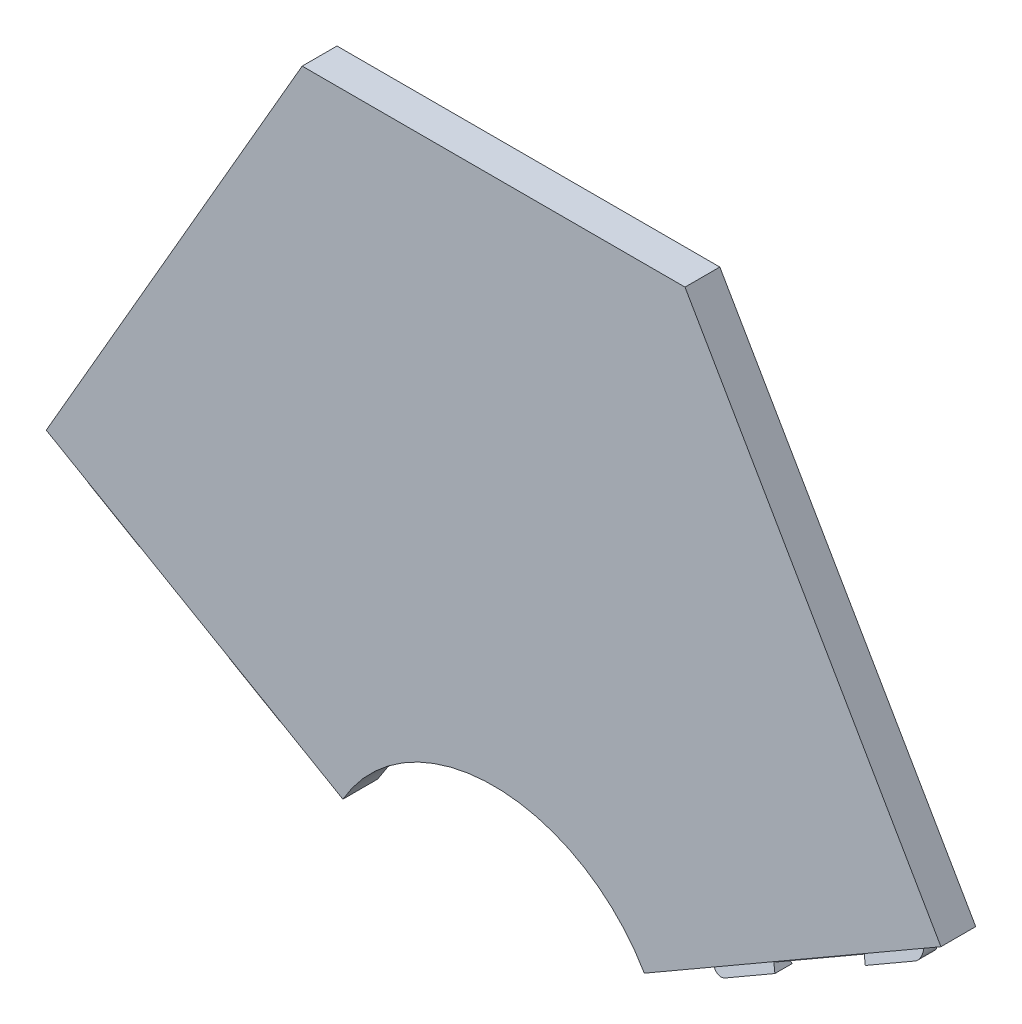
ISO-10303-21;
HEADER;
FILE_DESCRIPTION(('STEP AP214'),'2;1');
FILE_NAME('part.step','',(''),(''),'','','');
FILE_SCHEMA(('AUTOMOTIVE_DESIGN { 1 0 10303 214 1 1 1 1 }'));
ENDSEC;
DATA;
#1=APPLICATION_CONTEXT('core data for automotive mechanical design processes');
#2=APPLICATION_PROTOCOL_DEFINITION('international standard','automotive_design',2000,#1);
#3=PRODUCT_CONTEXT('',#1,'mechanical');
#4=PRODUCT('Part','Part','',(#3));
#5=PRODUCT_RELATED_PRODUCT_CATEGORY('part','',(#4));
#6=PRODUCT_DEFINITION_FORMATION('','',#4);
#7=PRODUCT_DEFINITION_CONTEXT('part definition',#1,'design');
#8=PRODUCT_DEFINITION('design','',#6,#7);
#9=PRODUCT_DEFINITION_SHAPE('','',#8);
#10=(LENGTH_UNIT() NAMED_UNIT(*) SI_UNIT(.MILLI.,.METRE.));
#11=(NAMED_UNIT(*) PLANE_ANGLE_UNIT() SI_UNIT($,.RADIAN.));
#12=(NAMED_UNIT(*) SI_UNIT($,.STERADIAN.) SOLID_ANGLE_UNIT());
#13=UNCERTAINTY_MEASURE_WITH_UNIT(LENGTH_MEASURE(1.E-05),#10,'distance_accuracy_value','');
#14=(GEOMETRIC_REPRESENTATION_CONTEXT(3) GLOBAL_UNCERTAINTY_ASSIGNED_CONTEXT((#13)) GLOBAL_UNIT_ASSIGNED_CONTEXT((#10,
#11,#12)) REPRESENTATION_CONTEXT('',''));
#15=CARTESIAN_POINT('',(0.,0.,0.));
#16=DIRECTION('',(0.,0.,1.));
#17=DIRECTION('',(1.,0.,0.));
#18=AXIS2_PLACEMENT_3D('',#15,#16,#17);
#19=CARTESIAN_POINT('',(128.536297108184,74.2104657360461,10.));
#20=DIRECTION('',(-0.499999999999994,0.866025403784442,0.));
#21=DIRECTION('',(-0.866025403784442,-0.499999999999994,0.));
#22=AXIS2_PLACEMENT_3D('',#19,#20,#21);
#23=PLANE('',#22);
#24=DIRECTION('',(0.866025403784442,0.499999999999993,0.));
#25=VECTOR('',#24,1.);
#26=CARTESIAN_POINT('',(59.2542648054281,34.2104657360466,6.2261041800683));
#27=LINE('',#26,#25);
#28=CARTESIAN_POINT('',(59.2542648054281,34.2104657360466,6.2261041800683));
#29=VERTEX_POINT('',#28);
#30=CARTESIAN_POINT('',(76.5747728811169,44.2104657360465,6.2261041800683));
#31=VERTEX_POINT('',#30);
#32=EDGE_CURVE('E278',#29,#31,#27,.T.);
#33=ORIENTED_EDGE('',*,*,#32,.T.);
#34=DIRECTION('',(0.866025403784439,0.499999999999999,0.));
#35=VECTOR('',#34,1.);
#36=CARTESIAN_POINT('',(-64.2698806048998,-37.1062328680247,6.2261041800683));
#37=LINE('',#36,#35);
#38=CARTESIAN_POINT('',(102.55553499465,59.2104657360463,6.2261041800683));
#39=VERTEX_POINT('',#38);
#40=EDGE_CURVE('E262',#31,#39,#37,.T.);
#41=ORIENTED_EDGE('',*,*,#40,.T.);
#42=DIRECTION('',(0.866025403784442,0.499999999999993,0.));
#43=VECTOR('',#42,1.);
#44=CARTESIAN_POINT('',(102.55553499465,59.2104657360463,6.2261041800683));
#45=LINE('',#44,#43);
#46=CARTESIAN_POINT('',(119.876043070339,69.2104657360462,6.2261041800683));
#47=VERTEX_POINT('',#46);
#48=EDGE_CURVE('E301',#39,#47,#45,.T.);
#49=ORIENTED_EDGE('',*,*,#48,.T.);
#50=DIRECTION('',(0.,0.,-1.));
#51=VECTOR('',#50,1.);
#52=CARTESIAN_POINT('',(119.876043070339,69.2104657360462,6.2261041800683));
#53=LINE('',#52,#51);
#54=CARTESIAN_POINT('',(119.876043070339,69.2104657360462,3.7738958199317));
#55=VERTEX_POINT('',#54);
#56=EDGE_CURVE('E248',#47,#55,#53,.T.);
#57=ORIENTED_EDGE('',*,*,#56,.T.);
#58=DIRECTION('',(0.866025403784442,0.499999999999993,0.));
#59=VECTOR('',#58,1.);
#60=CARTESIAN_POINT('',(102.55553499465,59.2104657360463,3.7738958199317));
#61=LINE('',#60,#59);
#62=CARTESIAN_POINT('',(102.55553499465,59.2104657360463,3.7738958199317));
#63=VERTEX_POINT('',#62);
#64=EDGE_CURVE('E257',#63,#55,#61,.T.);
#65=ORIENTED_EDGE('',*,*,#64,.F.);
#66=DIRECTION('',(0.866025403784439,0.499999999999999,0.));
#67=VECTOR('',#66,1.);
#68=CARTESIAN_POINT('',(-64.2698806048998,-37.1062328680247,3.7738958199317));
#69=LINE('',#68,#67);
#70=CARTESIAN_POINT('',(76.574772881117,44.2104657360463,3.7738958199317));
#71=VERTEX_POINT('',#70);
#72=EDGE_CURVE('E253',#71,#63,#69,.T.);
#73=ORIENTED_EDGE('',*,*,#72,.F.);
#74=DIRECTION('',(0.866025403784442,0.499999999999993,0.));
#75=VECTOR('',#74,1.);
#76=CARTESIAN_POINT('',(59.2542648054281,34.2104657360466,3.7738958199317));
#77=LINE('',#76,#75);
#78=CARTESIAN_POINT('',(59.2542648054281,34.2104657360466,3.7738958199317));
#79=VERTEX_POINT('',#78);
#80=EDGE_CURVE('E239',#79,#71,#77,.T.);
#81=ORIENTED_EDGE('',*,*,#80,.F.);
#82=DIRECTION('',(0.,0.,-1.));
#83=VECTOR('',#82,1.);
#84=CARTESIAN_POINT('',(59.2542648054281,34.2104657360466,6.2261041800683));
#85=LINE('',#84,#83);
#86=EDGE_CURVE('E236',#29,#79,#85,.T.);
#87=ORIENTED_EDGE('',*,*,#86,.F.);
#88=EDGE_LOOP('',(#33,#41,#49,#57,#65,#73,#81,#87));
#89=FACE_BOUND('',#88,.T.);
#90=DIRECTION('',(0.866025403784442,0.499999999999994,0.));
#91=VECTOR('',#90,1.);
#92=CARTESIAN_POINT('',(128.536297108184,74.2104657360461,0.));
#93=LINE('',#92,#91);
#94=CARTESIAN_POINT('',(43.3012701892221,24.9999999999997,0.));
#95=VERTEX_POINT('',#94);
#96=CARTESIAN_POINT('',(128.536297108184,74.2104657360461,0.));
#97=VERTEX_POINT('',#96);
#98=EDGE_CURVE('E438',#95,#97,#93,.T.);
#99=ORIENTED_EDGE('',*,*,#98,.T.);
#100=DIRECTION('',(0.,0.,-1.));
#101=VECTOR('',#100,1.);
#102=CARTESIAN_POINT('',(128.536297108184,74.2104657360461,10.));
#103=LINE('',#102,#101);
#104=CARTESIAN_POINT('',(128.536297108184,74.2104657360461,10.));
#105=VERTEX_POINT('',#104);
#106=EDGE_CURVE('E467',#105,#97,#103,.T.);
#107=ORIENTED_EDGE('',*,*,#106,.F.);
#108=DIRECTION('',(0.866025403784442,0.499999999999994,0.));
#109=VECTOR('',#108,1.);
#110=CARTESIAN_POINT('',(128.536297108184,74.2104657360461,10.));
#111=LINE('',#110,#109);
#112=CARTESIAN_POINT('',(43.3012701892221,24.9999999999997,10.));
#113=VERTEX_POINT('',#112);
#114=EDGE_CURVE('E418',#113,#105,#111,.T.);
#115=ORIENTED_EDGE('',*,*,#114,.F.);
#116=DIRECTION('',(0.,0.,-1.));
#117=VECTOR('',#116,1.);
#118=CARTESIAN_POINT('',(43.3012701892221,24.9999999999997,10.));
#119=LINE('',#118,#117);
#120=EDGE_CURVE('E471',#113,#95,#119,.T.);
#121=ORIENTED_EDGE('',*,*,#120,.T.);
#122=EDGE_LOOP('',(#99,#107,#115,#121));
#123=FACE_BOUND('',#122,.T.);
#124=ADVANCED_FACE('F51',(#89,#123),#23,.F.);
#125=CARTESIAN_POINT('',(-128.536297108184,74.2104657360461,10.));
#126=DIRECTION('',(0.499999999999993,0.866025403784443,0.));
#127=DIRECTION('',(-0.866025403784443,0.499999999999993,0.));
#128=AXIS2_PLACEMENT_3D('',#125,#126,#127);
#129=PLANE('',#128);
#130=DIRECTION('',(0.866025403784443,-0.499999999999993,0.));
#131=VECTOR('',#130,1.);
#132=CARTESIAN_POINT('',(-128.536297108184,74.2104657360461,0.));
#133=LINE('',#132,#131);
#134=CARTESIAN_POINT('',(-128.536297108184,74.2104657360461,0.));
#135=VERTEX_POINT('',#134);
#136=CARTESIAN_POINT('',(-43.3012701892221,24.9999999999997,0.));
#137=VERTEX_POINT('',#136);
#138=EDGE_CURVE('E419',#135,#137,#133,.T.);
#139=ORIENTED_EDGE('',*,*,#138,.T.);
#140=DIRECTION('',(0.,0.,-1.));
#141=VECTOR('',#140,1.);
#142=CARTESIAN_POINT('',(-43.3012701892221,24.9999999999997,10.));
#143=LINE('',#142,#141);
#144=CARTESIAN_POINT('',(-43.3012701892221,24.9999999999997,10.));
#145=VERTEX_POINT('',#144);
#146=EDGE_CURVE('E434',#145,#137,#143,.T.);
#147=ORIENTED_EDGE('',*,*,#146,.F.);
#148=DIRECTION('',(0.866025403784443,-0.499999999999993,0.));
#149=VECTOR('',#148,1.);
#150=CARTESIAN_POINT('',(-128.536297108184,74.2104657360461,10.));
#151=LINE('',#150,#149);
#152=CARTESIAN_POINT('',(-128.536297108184,74.2104657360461,10.));
#153=VERTEX_POINT('',#152);
#154=EDGE_CURVE('E431',#153,#145,#151,.T.);
#155=ORIENTED_EDGE('',*,*,#154,.F.);
#156=DIRECTION('',(0.,0.,-1.));
#157=VECTOR('',#156,1.);
#158=CARTESIAN_POINT('',(-128.536297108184,74.2104657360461,10.));
#159=LINE('',#158,#157);
#160=EDGE_CURVE('E455',#153,#135,#159,.T.);
#161=ORIENTED_EDGE('',*,*,#160,.T.);
#162=EDGE_LOOP('',(#139,#147,#155,#161));
#163=FACE_BOUND('',#162,.T.);
#164=DIRECTION('',(-0.866025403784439,0.499999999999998,0.));
#165=VECTOR('',#164,1.);
#166=CARTESIAN_POINT('',(64.2698806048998,-37.1062328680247,6.2261041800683));
#167=LINE('',#166,#165);
#168=CARTESIAN_POINT('',(-76.574772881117,44.2104657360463,6.2261041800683));
#169=VERTEX_POINT('',#168);
#170=CARTESIAN_POINT('',(-102.55553499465,59.2104657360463,6.2261041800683));
#171=VERTEX_POINT('',#170);
#172=EDGE_CURVE('E332',#169,#171,#167,.T.);
#173=ORIENTED_EDGE('',*,*,#172,.F.);
#174=DIRECTION('',(-0.866025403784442,0.499999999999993,0.));
#175=VECTOR('',#174,1.);
#176=CARTESIAN_POINT('',(-59.2542648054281,34.2104657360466,6.2261041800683));
#177=LINE('',#176,#175);
#178=CARTESIAN_POINT('',(-59.2542648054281,34.2104657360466,6.2261041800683));
#179=VERTEX_POINT('',#178);
#180=EDGE_CURVE('E368',#179,#169,#177,.T.);
#181=ORIENTED_EDGE('',*,*,#180,.F.);
#182=DIRECTION('',(0.,0.,-1.));
#183=VECTOR('',#182,1.);
#184=CARTESIAN_POINT('',(-59.2542648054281,34.2104657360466,6.2261041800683));
#185=LINE('',#184,#183);
#186=CARTESIAN_POINT('',(-59.2542648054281,34.2104657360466,3.7738958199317));
#187=VERTEX_POINT('',#186);
#188=EDGE_CURVE('E352',#179,#187,#185,.T.);
#189=ORIENTED_EDGE('',*,*,#188,.T.);
#190=DIRECTION('',(-0.866025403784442,0.499999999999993,0.));
#191=VECTOR('',#190,1.);
#192=CARTESIAN_POINT('',(-59.2542648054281,34.2104657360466,3.7738958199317));
#193=LINE('',#192,#191);
#194=CARTESIAN_POINT('',(-76.574772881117,44.2104657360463,3.7738958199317));
#195=VERTEX_POINT('',#194);
#196=EDGE_CURVE('E356',#187,#195,#193,.T.);
#197=ORIENTED_EDGE('',*,*,#196,.T.);
#198=DIRECTION('',(-0.866025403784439,0.499999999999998,0.));
#199=VECTOR('',#198,1.);
#200=CARTESIAN_POINT('',(64.2698806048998,-37.1062328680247,3.7738958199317));
#201=LINE('',#200,#199);
#202=CARTESIAN_POINT('',(-102.55553499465,59.2104657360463,3.7738958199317));
#203=VERTEX_POINT('',#202);
#204=EDGE_CURVE('E346',#195,#203,#201,.T.);
#205=ORIENTED_EDGE('',*,*,#204,.T.);
#206=DIRECTION('',(-0.866025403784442,0.499999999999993,0.));
#207=VECTOR('',#206,1.);
#208=CARTESIAN_POINT('',(-102.55553499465,59.2104657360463,3.7738958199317));
#209=LINE('',#208,#207);
#210=CARTESIAN_POINT('',(-119.876043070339,69.2104657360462,3.7738958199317));
#211=VERTEX_POINT('',#210);
#212=EDGE_CURVE('E394',#203,#211,#209,.T.);
#213=ORIENTED_EDGE('',*,*,#212,.T.);
#214=DIRECTION('',(0.,0.,-1.));
#215=VECTOR('',#214,1.);
#216=CARTESIAN_POINT('',(-119.876043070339,69.2104657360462,6.2261041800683));
#217=LINE('',#216,#215);
#218=CARTESIAN_POINT('',(-119.876043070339,69.2104657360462,6.2261041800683));
#219=VERTEX_POINT('',#218);
#220=EDGE_CURVE('E372',#219,#211,#217,.T.);
#221=ORIENTED_EDGE('',*,*,#220,.F.);
#222=DIRECTION('',(-0.866025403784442,0.499999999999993,0.));
#223=VECTOR('',#222,1.);
#224=CARTESIAN_POINT('',(-102.55553499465,59.2104657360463,6.2261041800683));
#225=LINE('',#224,#223);
#226=EDGE_CURVE('E398',#171,#219,#225,.T.);
#227=ORIENTED_EDGE('',*,*,#226,.F.);
#228=EDGE_LOOP('',(#173,#181,#189,#197,#205,#213,#221,#227));
#229=FACE_BOUND('',#228,.T.);
#230=ADVANCED_FACE('F552',(#163,#229),#129,.F.);
#231=CARTESIAN_POINT('',(-102.55553499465,59.2104657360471,0.));
#232=DIRECTION('',(-0.866025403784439,0.499999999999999,0.));
#233=DIRECTION('',(-0.499999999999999,-0.866025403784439,0.));
#234=AXIS2_PLACEMENT_3D('',#231,#232,#233);
#235=PLANE('',#234);
#236=DIRECTION('',(-0.5,-0.866025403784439,0.));
#237=VECTOR('',#236,1.);
#238=CARTESIAN_POINT('',(-102.55553499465,59.2104657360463,6.2261041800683));
#239=LINE('',#238,#237);
#240=CARTESIAN_POINT('',(-103.30553499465,57.9114276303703,6.2261041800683));
#241=VERTEX_POINT('',#240);
#242=EDGE_CURVE('E333',#171,#241,#239,.T.);
#243=ORIENTED_EDGE('',*,*,#242,.F.);
#244=DIRECTION('',(0.469846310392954,0.813797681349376,-0.342020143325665));
#245=VECTOR('',#244,1.);
#246=CARTESIAN_POINT('',(-104.30553499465,56.1793768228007,7.5));
#247=LINE('',#246,#245);
#248=CARTESIAN_POINT('',(-104.30553499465,56.1793768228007,7.5));
#249=VERTEX_POINT('',#248);
#250=EDGE_CURVE('E390',#249,#171,#247,.T.);
#251=ORIENTED_EDGE('',*,*,#250,.F.);
#252=DIRECTION('',(0.,0.,1.));
#253=VECTOR('',#252,1.);
#254=CARTESIAN_POINT('',(-104.30553499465,56.1793768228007,2.5));
#255=LINE('',#254,#253);
#256=CARTESIAN_POINT('',(-104.30553499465,56.1793768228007,2.5));
#257=VERTEX_POINT('',#256);
#258=EDGE_CURVE('E386',#257,#249,#255,.T.);
#259=ORIENTED_EDGE('',*,*,#258,.F.);
#260=DIRECTION('',(-0.469846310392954,-0.813797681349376,-0.342020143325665));
#261=VECTOR('',#260,1.);
#262=CARTESIAN_POINT('',(-102.55553499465,59.2104657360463,3.7738958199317));
#263=LINE('',#262,#261);
#264=EDGE_CURVE('E382',#203,#257,#263,.T.);
#265=ORIENTED_EDGE('',*,*,#264,.F.);
#266=DIRECTION('',(0.5,0.866025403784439,0.));
#267=VECTOR('',#266,1.);
#268=CARTESIAN_POINT('',(-102.55553499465,59.2104657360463,3.7738958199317));
#269=LINE('',#268,#267);
#270=CARTESIAN_POINT('',(-103.30553499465,57.9114276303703,3.7738958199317));
#271=VERTEX_POINT('',#270);
#272=EDGE_CURVE('E328',#271,#203,#269,.T.);
#273=ORIENTED_EDGE('',*,*,#272,.F.);
#274=DIRECTION('',(0.,0.,-1.));
#275=VECTOR('',#274,1.);
#276=CARTESIAN_POINT('',(-103.30553499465,57.9114276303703,6.2261041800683));
#277=LINE('',#276,#275);
#278=EDGE_CURVE('E331',#241,#271,#277,.T.);
#279=ORIENTED_EDGE('',*,*,#278,.F.);
#280=EDGE_LOOP('',(#243,#251,#259,#265,#273,#279));
#281=FACE_BOUND('',#280,.T.);
#282=ADVANCED_FACE('F559',(#281),#235,.F.);
#283=CARTESIAN_POINT('',(-76.5747728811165,44.2104657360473,0.));
#284=DIRECTION('',(-0.866025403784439,0.499999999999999,0.));
#285=DIRECTION('',(-0.499999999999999,-0.866025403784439,0.));
#286=AXIS2_PLACEMENT_3D('',#283,#284,#285);
#287=PLANE('',#286);
#288=DIRECTION('',(0.469846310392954,0.813797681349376,-0.342020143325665));
#289=VECTOR('',#288,1.);
#290=CARTESIAN_POINT('',(-78.3247728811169,41.179376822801,7.5));
#291=LINE('',#290,#289);
#292=CARTESIAN_POINT('',(-78.3247728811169,41.179376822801,7.5));
#293=VERTEX_POINT('',#292);
#294=EDGE_CURVE('E357',#293,#169,#291,.T.);
#295=ORIENTED_EDGE('',*,*,#294,.T.);
#296=DIRECTION('',(0.499999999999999,0.866025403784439,0.));
#297=VECTOR('',#296,1.);
#298=CARTESIAN_POINT('',(-76.574772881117,44.2104657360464,6.2261041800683));
#299=LINE('',#298,#297);
#300=CARTESIAN_POINT('',(-77.3247728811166,42.9114276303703,6.2261041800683));
#301=VERTEX_POINT('',#300);
#302=EDGE_CURVE('E306',#301,#169,#299,.T.);
#303=ORIENTED_EDGE('',*,*,#302,.F.);
#304=DIRECTION('',(0.,0.,1.));
#305=VECTOR('',#304,1.);
#306=CARTESIAN_POINT('',(-77.3247728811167,42.9114276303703,6.2261041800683));
#307=LINE('',#306,#305);
#308=CARTESIAN_POINT('',(-77.3247728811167,42.9114276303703,3.7738958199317));
#309=VERTEX_POINT('',#308);
#310=EDGE_CURVE('E320',#309,#301,#307,.T.);
#311=ORIENTED_EDGE('',*,*,#310,.F.);
#312=DIRECTION('',(-0.499999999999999,-0.866025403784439,0.));
#313=VECTOR('',#312,1.);
#314=CARTESIAN_POINT('',(-76.574772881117,44.2104657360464,3.7738958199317));
#315=LINE('',#314,#313);
#316=EDGE_CURVE('E323',#195,#309,#315,.T.);
#317=ORIENTED_EDGE('',*,*,#316,.F.);
#318=DIRECTION('',(-0.469846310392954,-0.813797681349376,-0.342020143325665));
#319=VECTOR('',#318,1.);
#320=CARTESIAN_POINT('',(-76.5747728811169,44.2104657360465,3.7738958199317));
#321=LINE('',#320,#319);
#322=CARTESIAN_POINT('',(-78.3247728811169,41.179376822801,2.5));
#323=VERTEX_POINT('',#322);
#324=EDGE_CURVE('E337',#195,#323,#321,.T.);
#325=ORIENTED_EDGE('',*,*,#324,.T.);
#326=DIRECTION('',(0.,0.,1.));
#327=VECTOR('',#326,1.);
#328=CARTESIAN_POINT('',(-78.3247728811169,41.179376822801,2.5));
#329=LINE('',#328,#327);
#330=EDGE_CURVE('E361',#323,#293,#329,.T.);
#331=ORIENTED_EDGE('',*,*,#330,.T.);
#332=EDGE_LOOP('',(#295,#303,#311,#317,#325,#331));
#333=FACE_BOUND('',#332,.T.);
#334=ADVANCED_FACE('F569',(#333),#287,.T.);
#335=CARTESIAN_POINT('',(0.,0.,10.));
#336=DIRECTION('',(0.,0.,-1.));
#337=DIRECTION('',(-1.,0.,0.));
#338=AXIS2_PLACEMENT_3D('',#335,#336,#337);
#339=CYLINDRICAL_SURFACE('',#338,50.);
#340=CARTESIAN_POINT('',(0.,0.,0.));
#341=DIRECTION('',(0.,0.,-1.));
#342=DIRECTION('',(1.,0.,0.));
#343=AXIS2_PLACEMENT_3D('',#340,#341,#342);
#344=CIRCLE('',#343,50.);
#345=EDGE_CURVE('E402',#137,#95,#344,.T.);
#346=ORIENTED_EDGE('',*,*,#345,.T.);
#347=ORIENTED_EDGE('',*,*,#120,.F.);
#348=CARTESIAN_POINT('',(0.,0.,10.));
#349=DIRECTION('',(0.,0.,-1.));
#350=DIRECTION('',(1.,0.,0.));
#351=AXIS2_PLACEMENT_3D('',#348,#349,#350);
#352=CIRCLE('',#351,50.);
#353=EDGE_CURVE('E414',#145,#113,#352,.T.);
#354=ORIENTED_EDGE('',*,*,#353,.F.);
#355=ORIENTED_EDGE('',*,*,#146,.T.);
#356=EDGE_LOOP('',(#346,#347,#354,#355));
#357=FACE_BOUND('',#356,.T.);
#358=ADVANCED_FACE('F566',(#357),#339,.F.);
#359=CARTESIAN_POINT('',(128.536297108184,74.2104657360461,10.));
#360=DIRECTION('',(-0.866025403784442,-0.499999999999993,0.));
#361=DIRECTION('',(0.499999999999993,-0.866025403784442,0.));
#362=AXIS2_PLACEMENT_3D('',#359,#360,#361);
#363=PLANE('',#362);
#364=DIRECTION('',(-0.499999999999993,0.866025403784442,0.));
#365=VECTOR('',#364,1.);
#366=CARTESIAN_POINT('',(128.536297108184,74.2104657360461,0.));
#367=LINE('',#366,#365);
#368=CARTESIAN_POINT('',(55.0000000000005,201.579068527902,0.));
#369=VERTEX_POINT('',#368);
#370=EDGE_CURVE('E441',#97,#369,#367,.T.);
#371=ORIENTED_EDGE('',*,*,#370,.T.);
#372=DIRECTION('',(0.,0.,-1.));
#373=VECTOR('',#372,1.);
#374=CARTESIAN_POINT('',(55.0000000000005,201.579068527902,10.));
#375=LINE('',#374,#373);
#376=CARTESIAN_POINT('',(55.0000000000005,201.579068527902,10.));
#377=VERTEX_POINT('',#376);
#378=EDGE_CURVE('E463',#377,#369,#375,.T.);
#379=ORIENTED_EDGE('',*,*,#378,.F.);
#380=DIRECTION('',(-0.499999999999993,0.866025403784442,0.));
#381=VECTOR('',#380,1.);
#382=CARTESIAN_POINT('',(128.536297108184,74.2104657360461,10.));
#383=LINE('',#382,#381);
#384=EDGE_CURVE('E422',#105,#377,#383,.T.);
#385=ORIENTED_EDGE('',*,*,#384,.F.);
#386=ORIENTED_EDGE('',*,*,#106,.T.);
#387=EDGE_LOOP('',(#371,#379,#385,#386));
#388=FACE_BOUND('',#387,.T.);
#389=ADVANCED_FACE('F564',(#388),#363,.F.);
#390=CARTESIAN_POINT('',(-55.0000000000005,201.579068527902,10.));
#391=DIRECTION('',(0.,-1.,0.));
#392=DIRECTION('',(0.,0.,-1.));
#393=AXIS2_PLACEMENT_3D('',#390,#391,#392);
#394=PLANE('',#393);
#395=DIRECTION('',(-1.,0.,0.));
#396=VECTOR('',#395,1.);
#397=CARTESIAN_POINT('',(-55.0000000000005,201.579068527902,0.));
#398=LINE('',#397,#396);
#399=CARTESIAN_POINT('',(-55.0000000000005,201.579068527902,0.));
#400=VERTEX_POINT('',#399);
#401=EDGE_CURVE('E444',#369,#400,#398,.T.);
#402=ORIENTED_EDGE('',*,*,#401,.T.);
#403=DIRECTION('',(0.,0.,-1.));
#404=VECTOR('',#403,1.);
#405=CARTESIAN_POINT('',(-55.0000000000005,201.579068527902,10.));
#406=LINE('',#405,#404);
#407=CARTESIAN_POINT('',(-55.0000000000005,201.579068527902,10.));
#408=VERTEX_POINT('',#407);
#409=EDGE_CURVE('E459',#408,#400,#406,.T.);
#410=ORIENTED_EDGE('',*,*,#409,.F.);
#411=DIRECTION('',(-1.,0.,0.));
#412=VECTOR('',#411,1.);
#413=CARTESIAN_POINT('',(-55.0000000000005,201.579068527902,10.));
#414=LINE('',#413,#412);
#415=EDGE_CURVE('E425',#377,#408,#414,.T.);
#416=ORIENTED_EDGE('',*,*,#415,.F.);
#417=ORIENTED_EDGE('',*,*,#378,.T.);
#418=EDGE_LOOP('',(#402,#410,#416,#417));
#419=FACE_BOUND('',#418,.T.);
#420=ADVANCED_FACE('F658',(#419),#394,.F.);
#421=CARTESIAN_POINT('',(-128.536297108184,74.2104657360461,10.));
#422=DIRECTION('',(0.866025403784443,-0.499999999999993,0.));
#423=DIRECTION('',(0.499999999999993,0.866025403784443,0.));
#424=AXIS2_PLACEMENT_3D('',#421,#422,#423);
#425=PLANE('',#424);
#426=DIRECTION('',(-0.499999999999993,-0.866025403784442,0.));
#427=VECTOR('',#426,1.);
#428=CARTESIAN_POINT('',(-128.536297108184,74.2104657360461,0.));
#429=LINE('',#428,#427);
#430=EDGE_CURVE('E447',#400,#135,#429,.T.);
#431=ORIENTED_EDGE('',*,*,#430,.T.);
#432=ORIENTED_EDGE('',*,*,#160,.F.);
#433=DIRECTION('',(-0.499999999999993,-0.866025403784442,0.));
#434=VECTOR('',#433,1.);
#435=CARTESIAN_POINT('',(-128.536297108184,74.2104657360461,10.));
#436=LINE('',#435,#434);
#437=EDGE_CURVE('E428',#408,#153,#436,.T.);
#438=ORIENTED_EDGE('',*,*,#437,.F.);
#439=ORIENTED_EDGE('',*,*,#409,.T.);
#440=EDGE_LOOP('',(#431,#432,#438,#439));
#441=FACE_BOUND('',#440,.T.);
#442=ADVANCED_FACE('F652',(#441),#425,.F.);
#443=CARTESIAN_POINT('',(0.,0.,10.));
#444=DIRECTION('',(0.,0.,1.));
#445=DIRECTION('',(1.,0.,0.));
#446=AXIS2_PLACEMENT_3D('',#443,#444,#445);
#447=PLANE('',#446);
#448=ORIENTED_EDGE('',*,*,#353,.T.);
#449=ORIENTED_EDGE('',*,*,#114,.T.);
#450=ORIENTED_EDGE('',*,*,#384,.T.);
#451=ORIENTED_EDGE('',*,*,#415,.T.);
#452=ORIENTED_EDGE('',*,*,#437,.T.);
#453=ORIENTED_EDGE('',*,*,#154,.T.);
#454=EDGE_LOOP('',(#448,#449,#450,#451,#452,#453));
#455=FACE_BOUND('',#454,.T.);
#456=ADVANCED_FACE('F649',(#455),#447,.T.);
#457=CARTESIAN_POINT('',(0.,0.,0.));
#458=DIRECTION('',(0.,0.,1.));
#459=DIRECTION('',(1.,0.,0.));
#460=AXIS2_PLACEMENT_3D('',#457,#458,#459);
#461=PLANE('',#460);
#462=ORIENTED_EDGE('',*,*,#345,.F.);
#463=ORIENTED_EDGE('',*,*,#138,.F.);
#464=ORIENTED_EDGE('',*,*,#430,.F.);
#465=ORIENTED_EDGE('',*,*,#401,.F.);
#466=ORIENTED_EDGE('',*,*,#370,.F.);
#467=ORIENTED_EDGE('',*,*,#98,.F.);
#468=EDGE_LOOP('',(#462,#463,#464,#465,#466,#467));
#469=FACE_BOUND('',#468,.T.);
#470=ADVANCED_FACE('F641',(#469),#461,.F.);
#471=CARTESIAN_POINT('',(-104.30553499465,56.1793768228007,7.5));
#472=DIRECTION('',(0.17101007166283,0.296198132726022,0.93969262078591));
#473=DIRECTION('',(0.,-0.953741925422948,0.30062657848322));
#474=AXIS2_PLACEMENT_3D('',#471,#472,#473);
#475=PLANE('',#474);
#476=ORIENTED_EDGE('',*,*,#226,.T.);
#477=CARTESIAN_POINT('',(-116.844954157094,67.4604657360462,6.22610418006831));
#478=DIRECTION('',(0.17101007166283,0.296198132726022,0.93969262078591));
#479=DIRECTION('',(-0.469846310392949,-0.813797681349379,0.342020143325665));
#480=AXIS2_PLACEMENT_3D('',#477,#478,#479);
#481=ELLIPSE('',#480,3.72462220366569,3.5);
#482=CARTESIAN_POINT('',(-118.594954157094,64.4293768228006,7.5));
#483=VERTEX_POINT('',#482);
#484=EDGE_CURVE('E485',#219,#483,#481,.T.);
#485=ORIENTED_EDGE('',*,*,#484,.T.);
#486=DIRECTION('',(-0.866025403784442,0.499999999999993,0.));
#487=VECTOR('',#486,1.);
#488=CARTESIAN_POINT('',(-104.30553499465,56.1793768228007,7.5));
#489=LINE('',#488,#487);
#490=EDGE_CURVE('E403',#249,#483,#489,.T.);
#491=ORIENTED_EDGE('',*,*,#490,.F.);
#492=ORIENTED_EDGE('',*,*,#250,.T.);
#493=EDGE_LOOP('',(#476,#485,#491,#492));
#494=FACE_BOUND('',#493,.T.);
#495=ADVANCED_FACE('F637',(#494),#475,.T.);
#496=CARTESIAN_POINT('',(-104.30553499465,56.1793768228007,2.5));
#497=DIRECTION('',(-0.499999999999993,-0.866025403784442,0.));
#498=DIRECTION('',(0.866025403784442,-0.499999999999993,0.));
#499=AXIS2_PLACEMENT_3D('',#496,#497,#498);
#500=PLANE('',#499);
#501=ORIENTED_EDGE('',*,*,#490,.T.);
#502=DIRECTION('',(0.,0.,1.));
#503=VECTOR('',#502,1.);
#504=CARTESIAN_POINT('',(-118.594954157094,64.4293768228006,2.5));
#505=LINE('',#504,#503);
#506=CARTESIAN_POINT('',(-118.594954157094,64.4293768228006,2.5));
#507=VERTEX_POINT('',#506);
#508=EDGE_CURVE('E488',#483,#507,#505,.F.);
#509=ORIENTED_EDGE('',*,*,#508,.T.);
#510=DIRECTION('',(-0.866025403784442,0.499999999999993,0.));
#511=VECTOR('',#510,1.);
#512=CARTESIAN_POINT('',(-104.30553499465,56.1793768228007,2.5));
#513=LINE('',#512,#511);
#514=EDGE_CURVE('E407',#257,#507,#513,.T.);
#515=ORIENTED_EDGE('',*,*,#514,.F.);
#516=ORIENTED_EDGE('',*,*,#258,.T.);
#517=EDGE_LOOP('',(#501,#509,#515,#516));
#518=FACE_BOUND('',#517,.T.);
#519=ADVANCED_FACE('F640',(#518),#500,.T.);
#520=CARTESIAN_POINT('',(-102.55553499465,59.2104657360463,3.7738958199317));
#521=DIRECTION('',(0.17101007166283,0.296198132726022,-0.93969262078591));
#522=DIRECTION('',(0.,0.953741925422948,0.30062657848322));
#523=AXIS2_PLACEMENT_3D('',#520,#521,#522);
#524=PLANE('',#523);
#525=ORIENTED_EDGE('',*,*,#514,.T.);
#526=CARTESIAN_POINT('',(-116.844954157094,67.4604657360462,3.77389581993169));
#527=DIRECTION('',(0.17101007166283,0.296198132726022,-0.93969262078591));
#528=DIRECTION('',(0.469846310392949,0.813797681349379,0.342020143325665));
#529=AXIS2_PLACEMENT_3D('',#526,#527,#528);
#530=ELLIPSE('',#529,3.72462220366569,3.5);
#531=EDGE_CURVE('E491',#507,#211,#530,.T.);
#532=ORIENTED_EDGE('',*,*,#531,.T.);
#533=ORIENTED_EDGE('',*,*,#212,.F.);
#534=ORIENTED_EDGE('',*,*,#264,.T.);
#535=EDGE_LOOP('',(#525,#532,#533,#534));
#536=FACE_BOUND('',#535,.T.);
#537=ADVANCED_FACE('F626',(#536),#524,.T.);
#538=CARTESIAN_POINT('',(-61.0042648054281,31.1793768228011,7.5));
#539=DIRECTION('',(0.17101007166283,0.296198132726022,0.93969262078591));
#540=DIRECTION('',(0.,-0.953741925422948,0.30062657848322));
#541=AXIS2_PLACEMENT_3D('',#538,#539,#540);
#542=PLANE('',#541);
#543=DIRECTION('',(-0.866025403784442,0.499999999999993,0.));
#544=VECTOR('',#543,1.);
#545=CARTESIAN_POINT('',(-61.0042648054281,31.1793768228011,7.5));
#546=LINE('',#545,#544);
#547=CARTESIAN_POINT('',(-64.0353537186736,32.9293768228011,7.5));
#548=VERTEX_POINT('',#547);
#549=EDGE_CURVE('E373',#548,#293,#546,.T.);
#550=ORIENTED_EDGE('',*,*,#549,.F.);
#551=CARTESIAN_POINT('',(-62.2853537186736,35.9604657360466,6.22610418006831));
#552=DIRECTION('',(0.17101007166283,0.296198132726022,0.93969262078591));
#553=DIRECTION('',(0.469846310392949,0.813797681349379,-0.342020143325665));
#554=AXIS2_PLACEMENT_3D('',#551,#552,#553);
#555=ELLIPSE('',#554,3.72462220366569,3.5);
#556=EDGE_CURVE('E479',#548,#179,#555,.T.);
#557=ORIENTED_EDGE('',*,*,#556,.T.);
#558=ORIENTED_EDGE('',*,*,#180,.T.);
#559=ORIENTED_EDGE('',*,*,#294,.F.);
#560=EDGE_LOOP('',(#550,#557,#558,#559));
#561=FACE_BOUND('',#560,.T.);
#562=ADVANCED_FACE('F622',(#561),#542,.T.);
#563=CARTESIAN_POINT('',(-61.0042648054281,31.1793768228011,2.5));
#564=DIRECTION('',(-0.499999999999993,-0.866025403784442,0.));
#565=DIRECTION('',(0.866025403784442,-0.499999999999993,0.));
#566=AXIS2_PLACEMENT_3D('',#563,#564,#565);
#567=PLANE('',#566);
#568=DIRECTION('',(-0.866025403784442,0.499999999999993,0.));
#569=VECTOR('',#568,1.);
#570=CARTESIAN_POINT('',(-61.0042648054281,31.1793768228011,2.5));
#571=LINE('',#570,#569);
#572=CARTESIAN_POINT('',(-64.0353537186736,32.9293768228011,2.5));
#573=VERTEX_POINT('',#572);
#574=EDGE_CURVE('E376',#573,#323,#571,.T.);
#575=ORIENTED_EDGE('',*,*,#574,.F.);
#576=DIRECTION('',(0.,0.,1.));
#577=VECTOR('',#576,1.);
#578=CARTESIAN_POINT('',(-64.0353537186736,32.9293768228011,7.5));
#579=LINE('',#578,#577);
#580=EDGE_CURVE('E475',#573,#548,#579,.T.);
#581=ORIENTED_EDGE('',*,*,#580,.T.);
#582=ORIENTED_EDGE('',*,*,#549,.T.);
#583=ORIENTED_EDGE('',*,*,#330,.F.);
#584=EDGE_LOOP('',(#575,#581,#582,#583));
#585=FACE_BOUND('',#584,.T.);
#586=ADVANCED_FACE('F625',(#585),#567,.T.);
#587=CARTESIAN_POINT('',(-59.2542648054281,34.2104657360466,3.7738958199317));
#588=DIRECTION('',(0.17101007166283,0.296198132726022,-0.93969262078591));
#589=DIRECTION('',(0.,0.953741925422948,0.30062657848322));
#590=AXIS2_PLACEMENT_3D('',#587,#588,#589);
#591=PLANE('',#590);
#592=ORIENTED_EDGE('',*,*,#196,.F.);
#593=CARTESIAN_POINT('',(-62.2853537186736,35.9604657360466,3.77389581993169));
#594=DIRECTION('',(0.17101007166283,0.296198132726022,-0.93969262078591));
#595=DIRECTION('',(-0.469846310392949,-0.813797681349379,-0.342020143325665));
#596=AXIS2_PLACEMENT_3D('',#593,#594,#595);
#597=ELLIPSE('',#596,3.72462220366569,3.5);
#598=EDGE_CURVE('E482',#187,#573,#597,.T.);
#599=ORIENTED_EDGE('',*,*,#598,.T.);
#600=ORIENTED_EDGE('',*,*,#574,.T.);
#601=ORIENTED_EDGE('',*,*,#324,.F.);
#602=EDGE_LOOP('',(#592,#599,#600,#601));
#603=FACE_BOUND('',#602,.T.);
#604=ADVANCED_FACE('F575',(#603),#591,.T.);
#605=CARTESIAN_POINT('',(-62.2853537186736,35.9604657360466,2.5));
#606=DIRECTION('',(0.,0.,-1.));
#607=DIRECTION('',(-1.,0.,0.));
#608=AXIS2_PLACEMENT_3D('',#605,#606,#607);
#609=CYLINDRICAL_SURFACE('',#608,3.5);
#610=ORIENTED_EDGE('',*,*,#598,.F.);
#611=ORIENTED_EDGE('',*,*,#188,.F.);
#612=ORIENTED_EDGE('',*,*,#556,.F.);
#613=ORIENTED_EDGE('',*,*,#580,.F.);
#614=EDGE_LOOP('',(#610,#611,#612,#613));
#615=FACE_BOUND('',#614,.T.);
#616=ADVANCED_FACE('F571',(#615),#609,.T.);
#617=CARTESIAN_POINT('',(-116.844954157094,67.4604657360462,0.));
#618=DIRECTION('',(0.,0.,1.));
#619=DIRECTION('',(1.,0.,0.));
#620=AXIS2_PLACEMENT_3D('',#617,#618,#619);
#621=CYLINDRICAL_SURFACE('',#620,3.5);
#622=ORIENTED_EDGE('',*,*,#531,.F.);
#623=ORIENTED_EDGE('',*,*,#508,.F.);
#624=ORIENTED_EDGE('',*,*,#484,.F.);
#625=ORIENTED_EDGE('',*,*,#220,.T.);
#626=EDGE_LOOP('',(#622,#623,#624,#625));
#627=FACE_BOUND('',#626,.T.);
#628=ADVANCED_FACE('F574',(#627),#621,.T.);
#629=CARTESIAN_POINT('',(64.2698806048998,-37.1062328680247,6.2261041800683));
#630=DIRECTION('',(0.,0.,-1.));
#631=DIRECTION('',(-1.,0.,0.));
#632=AXIS2_PLACEMENT_3D('',#629,#630,#631);
#633=PLANE('',#632);
#634=DIRECTION('',(-0.866025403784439,0.499999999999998,0.));
#635=VECTOR('',#634,1.);
#636=CARTESIAN_POINT('',(63.5198806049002,-38.4052709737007,6.2261041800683));
#637=LINE('',#636,#635);
#638=EDGE_CURVE('E327',#301,#241,#637,.T.);
#639=ORIENTED_EDGE('',*,*,#638,.F.);
#640=ORIENTED_EDGE('',*,*,#302,.T.);
#641=ORIENTED_EDGE('',*,*,#172,.T.);
#642=ORIENTED_EDGE('',*,*,#242,.T.);
#643=EDGE_LOOP('',(#639,#640,#641,#642));
#644=FACE_BOUND('',#643,.T.);
#645=ADVANCED_FACE('F578',(#644),#633,.F.);
#646=CARTESIAN_POINT('',(64.2698806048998,-37.1062328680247,3.7738958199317));
#647=DIRECTION('',(0.,0.,1.));
#648=DIRECTION('',(1.,0.,0.));
#649=AXIS2_PLACEMENT_3D('',#646,#647,#648);
#650=PLANE('',#649);
#651=ORIENTED_EDGE('',*,*,#204,.F.);
#652=ORIENTED_EDGE('',*,*,#316,.T.);
#653=DIRECTION('',(-0.866025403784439,0.499999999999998,0.));
#654=VECTOR('',#653,1.);
#655=CARTESIAN_POINT('',(63.5198806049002,-38.4052709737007,3.7738958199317));
#656=LINE('',#655,#654);
#657=EDGE_CURVE('E343',#309,#271,#656,.T.);
#658=ORIENTED_EDGE('',*,*,#657,.T.);
#659=ORIENTED_EDGE('',*,*,#272,.T.);
#660=EDGE_LOOP('',(#651,#652,#658,#659));
#661=FACE_BOUND('',#660,.T.);
#662=ADVANCED_FACE('F612',(#661),#650,.F.);
#663=CARTESIAN_POINT('',(63.5198806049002,-38.4052709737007,6.2261041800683));
#664=DIRECTION('',(0.499999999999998,0.866025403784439,0.));
#665=DIRECTION('',(-0.86602540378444,0.499999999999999,0.));
#666=AXIS2_PLACEMENT_3D('',#663,#664,#665);
#667=PLANE('',#666);
#668=ORIENTED_EDGE('',*,*,#657,.F.);
#669=ORIENTED_EDGE('',*,*,#310,.T.);
#670=ORIENTED_EDGE('',*,*,#638,.T.);
#671=ORIENTED_EDGE('',*,*,#278,.T.);
#672=EDGE_LOOP('',(#668,#669,#670,#671));
#673=FACE_BOUND('',#672,.T.);
#674=ADVANCED_FACE('F580',(#673),#667,.F.);
#675=CARTESIAN_POINT('',(102.55553499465,59.2104657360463,3.7738958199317));
#676=DIRECTION('',(0.17101007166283,-0.296198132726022,0.93969262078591));
#677=DIRECTION('',(0.,-0.953741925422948,-0.30062657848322));
#678=AXIS2_PLACEMENT_3D('',#675,#676,#677);
#679=PLANE('',#678);
#680=ORIENTED_EDGE('',*,*,#64,.T.);
#681=CARTESIAN_POINT('',(116.844954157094,67.4604657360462,3.77389581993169));
#682=DIRECTION('',(0.17101007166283,-0.296198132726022,0.93969262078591));
#683=DIRECTION('',(0.469846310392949,-0.813797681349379,-0.342020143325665));
#684=AXIS2_PLACEMENT_3D('',#681,#682,#683);
#685=ELLIPSE('',#684,3.72462220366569,3.5);
#686=CARTESIAN_POINT('',(118.594954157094,64.4293768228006,2.5));
#687=VERTEX_POINT('',#686);
#688=EDGE_CURVE('E11',#55,#687,#685,.F.);
#689=ORIENTED_EDGE('',*,*,#688,.T.);
#690=DIRECTION('',(0.866025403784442,0.499999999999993,0.));
#691=VECTOR('',#690,1.);
#692=CARTESIAN_POINT('',(104.30553499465,56.1793768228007,2.5));
#693=LINE('',#692,#691);
#694=CARTESIAN_POINT('',(104.30553499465,56.1793768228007,2.5));
#695=VERTEX_POINT('',#694);
#696=EDGE_CURVE('E307',#695,#687,#693,.T.);
#697=ORIENTED_EDGE('',*,*,#696,.F.);
#698=DIRECTION('',(0.469846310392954,-0.813797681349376,-0.342020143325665));
#699=VECTOR('',#698,1.);
#700=CARTESIAN_POINT('',(102.55553499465,59.2104657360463,3.7738958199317));
#701=LINE('',#700,#699);
#702=EDGE_CURVE('E298',#63,#695,#701,.T.);
#703=ORIENTED_EDGE('',*,*,#702,.F.);
#704=EDGE_LOOP('',(#680,#689,#697,#703));
#705=FACE_BOUND('',#704,.T.);
#706=ADVANCED_FACE('F518',(#705),#679,.F.);
#707=CARTESIAN_POINT('',(104.30553499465,56.1793768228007,2.5));
#708=DIRECTION('',(-0.499999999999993,0.866025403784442,0.));
#709=DIRECTION('',(-0.866025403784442,-0.499999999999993,0.));
#710=AXIS2_PLACEMENT_3D('',#707,#708,#709);
#711=PLANE('',#710);
#712=ORIENTED_EDGE('',*,*,#696,.T.);
#713=DIRECTION('',(0.,0.,1.));
#714=VECTOR('',#713,1.);
#715=CARTESIAN_POINT('',(118.594954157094,64.4293768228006,7.5));
#716=LINE('',#715,#714);
#717=CARTESIAN_POINT('',(118.594954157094,64.4293768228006,7.5));
#718=VERTEX_POINT('',#717);
#719=EDGE_CURVE('E502',#687,#718,#716,.T.);
#720=ORIENTED_EDGE('',*,*,#719,.T.);
#721=DIRECTION('',(0.866025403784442,0.499999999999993,0.));
#722=VECTOR('',#721,1.);
#723=CARTESIAN_POINT('',(104.30553499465,56.1793768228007,7.5));
#724=LINE('',#723,#722);
#725=CARTESIAN_POINT('',(104.30553499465,56.1793768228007,7.5));
#726=VERTEX_POINT('',#725);
#727=EDGE_CURVE('E311',#726,#718,#724,.T.);
#728=ORIENTED_EDGE('',*,*,#727,.F.);
#729=DIRECTION('',(0.,0.,1.));
#730=VECTOR('',#729,1.);
#731=CARTESIAN_POINT('',(104.30553499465,56.1793768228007,2.5));
#732=LINE('',#731,#730);
#733=EDGE_CURVE('E295',#695,#726,#732,.T.);
#734=ORIENTED_EDGE('',*,*,#733,.F.);
#735=EDGE_LOOP('',(#712,#720,#728,#734));
#736=FACE_BOUND('',#735,.T.);
#737=ADVANCED_FACE('F522',(#736),#711,.F.);
#738=CARTESIAN_POINT('',(104.30553499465,56.1793768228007,7.5));
#739=DIRECTION('',(0.17101007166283,-0.296198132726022,-0.93969262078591));
#740=DIRECTION('',(0.,0.953741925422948,-0.30062657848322));
#741=AXIS2_PLACEMENT_3D('',#738,#739,#740);
#742=PLANE('',#741);
#743=ORIENTED_EDGE('',*,*,#727,.T.);
#744=CARTESIAN_POINT('',(116.844954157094,67.4604657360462,6.22610418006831));
#745=DIRECTION('',(0.17101007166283,-0.296198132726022,-0.93969262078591));
#746=DIRECTION('',(-0.469846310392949,0.813797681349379,-0.342020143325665));
#747=AXIS2_PLACEMENT_3D('',#744,#745,#746);
#748=ELLIPSE('',#747,3.72462220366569,3.5);
#749=EDGE_CURVE('E60',#718,#47,#748,.F.);
#750=ORIENTED_EDGE('',*,*,#749,.T.);
#751=ORIENTED_EDGE('',*,*,#48,.F.);
#752=DIRECTION('',(-0.469846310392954,0.813797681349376,-0.342020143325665));
#753=VECTOR('',#752,1.);
#754=CARTESIAN_POINT('',(104.30553499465,56.1793768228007,7.5));
#755=LINE('',#754,#753);
#756=EDGE_CURVE('E292',#726,#39,#755,.T.);
#757=ORIENTED_EDGE('',*,*,#756,.F.);
#758=EDGE_LOOP('',(#743,#750,#751,#757));
#759=FACE_BOUND('',#758,.T.);
#760=ADVANCED_FACE('F508',(#759),#742,.F.);
#761=CARTESIAN_POINT('',(102.55553499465,59.2104657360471,0.));
#762=DIRECTION('',(0.866025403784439,0.499999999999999,0.));
#763=DIRECTION('',(0.499999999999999,-0.866025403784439,0.));
#764=AXIS2_PLACEMENT_3D('',#761,#762,#763);
#765=PLANE('',#764);
#766=ORIENTED_EDGE('',*,*,#756,.T.);
#767=DIRECTION('',(0.5,-0.866025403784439,0.));
#768=VECTOR('',#767,1.);
#769=CARTESIAN_POINT('',(102.55553499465,59.2104657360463,6.2261041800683));
#770=LINE('',#769,#768);
#771=CARTESIAN_POINT('',(103.30553499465,57.9114276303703,6.2261041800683));
#772=VERTEX_POINT('',#771);
#773=EDGE_CURVE('E67',#39,#772,#770,.T.);
#774=ORIENTED_EDGE('',*,*,#773,.T.);
#775=DIRECTION('',(0.,0.,-1.));
#776=VECTOR('',#775,1.);
#777=CARTESIAN_POINT('',(103.30553499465,57.9114276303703,6.2261041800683));
#778=LINE('',#777,#776);
#779=CARTESIAN_POINT('',(103.30553499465,57.9114276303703,3.7738958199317));
#780=VERTEX_POINT('',#779);
#781=EDGE_CURVE('E72',#772,#780,#778,.T.);
#782=ORIENTED_EDGE('',*,*,#781,.T.);
#783=DIRECTION('',(-0.5,0.866025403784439,0.));
#784=VECTOR('',#783,1.);
#785=CARTESIAN_POINT('',(102.55553499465,59.2104657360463,3.7738958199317));
#786=LINE('',#785,#784);
#787=EDGE_CURVE('E524',#780,#63,#786,.T.);
#788=ORIENTED_EDGE('',*,*,#787,.T.);
#789=ORIENTED_EDGE('',*,*,#702,.T.);
#790=ORIENTED_EDGE('',*,*,#733,.T.);
#791=EDGE_LOOP('',(#766,#774,#782,#788,#789,#790));
#792=FACE_BOUND('',#791,.T.);
#793=ADVANCED_FACE('F523',(#792),#765,.F.);
#794=CARTESIAN_POINT('',(59.2542648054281,34.2104657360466,3.7738958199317));
#795=DIRECTION('',(0.17101007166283,-0.296198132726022,0.93969262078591));
#796=DIRECTION('',(0.,-0.953741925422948,-0.30062657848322));
#797=AXIS2_PLACEMENT_3D('',#794,#795,#796);
#798=PLANE('',#797);
#799=DIRECTION('',(0.866025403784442,0.499999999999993,0.));
#800=VECTOR('',#799,1.);
#801=CARTESIAN_POINT('',(61.0042648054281,31.1793768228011,2.5));
#802=LINE('',#801,#800);
#803=CARTESIAN_POINT('',(64.0353537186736,32.929376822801,2.5));
#804=VERTEX_POINT('',#803);
#805=CARTESIAN_POINT('',(78.3247728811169,41.1793768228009,2.5));
#806=VERTEX_POINT('',#805);
#807=EDGE_CURVE('E249',#804,#806,#802,.T.);
#808=ORIENTED_EDGE('',*,*,#807,.F.);
#809=CARTESIAN_POINT('',(62.2853537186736,35.9604657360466,3.77389581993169));
#810=DIRECTION('',(0.17101007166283,-0.296198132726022,0.93969262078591));
#811=DIRECTION('',(-0.469846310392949,0.813797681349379,0.342020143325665));
#812=AXIS2_PLACEMENT_3D('',#809,#810,#811);
#813=ELLIPSE('',#812,3.72462220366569,3.5);
#814=EDGE_CURVE('E243',#804,#79,#813,.F.);
#815=ORIENTED_EDGE('',*,*,#814,.T.);
#816=ORIENTED_EDGE('',*,*,#80,.T.);
#817=DIRECTION('',(0.469846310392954,-0.813797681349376,-0.342020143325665));
#818=VECTOR('',#817,1.);
#819=CARTESIAN_POINT('',(76.5747728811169,44.2104657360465,3.7738958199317));
#820=LINE('',#819,#818);
#821=EDGE_CURVE('E224',#71,#806,#820,.T.);
#822=ORIENTED_EDGE('',*,*,#821,.T.);
#823=EDGE_LOOP('',(#808,#815,#816,#822));
#824=FACE_BOUND('',#823,.T.);
#825=ADVANCED_FACE('F241',(#824),#798,.F.);
#826=CARTESIAN_POINT('',(61.0042648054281,31.1793768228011,2.5));
#827=DIRECTION('',(-0.499999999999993,0.866025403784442,0.));
#828=DIRECTION('',(-0.866025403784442,-0.499999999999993,0.));
#829=AXIS2_PLACEMENT_3D('',#826,#827,#828);
#830=PLANE('',#829);
#831=DIRECTION('',(0.866025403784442,0.499999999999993,0.));
#832=VECTOR('',#831,1.);
#833=CARTESIAN_POINT('',(61.0042648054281,31.1793768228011,7.5));
#834=LINE('',#833,#832);
#835=CARTESIAN_POINT('',(64.0353537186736,32.929376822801,7.5));
#836=VERTEX_POINT('',#835);
#837=CARTESIAN_POINT('',(78.3247728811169,41.1793768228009,7.5));
#838=VERTEX_POINT('',#837);
#839=EDGE_CURVE('E287',#836,#838,#834,.T.);
#840=ORIENTED_EDGE('',*,*,#839,.F.);
#841=DIRECTION('',(0.,0.,1.));
#842=VECTOR('',#841,1.);
#843=CARTESIAN_POINT('',(64.0353537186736,32.929376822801,2.5));
#844=LINE('',#843,#842);
#845=EDGE_CURVE('E497',#836,#804,#844,.F.);
#846=ORIENTED_EDGE('',*,*,#845,.T.);
#847=ORIENTED_EDGE('',*,*,#807,.T.);
#848=DIRECTION('',(0.,0.,1.));
#849=VECTOR('',#848,1.);
#850=CARTESIAN_POINT('',(78.3247728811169,41.1793768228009,2.5));
#851=LINE('',#850,#849);
#852=EDGE_CURVE('E232',#806,#838,#851,.T.);
#853=ORIENTED_EDGE('',*,*,#852,.T.);
#854=EDGE_LOOP('',(#840,#846,#847,#853));
#855=FACE_BOUND('',#854,.T.);
#856=ADVANCED_FACE('F593',(#855),#830,.F.);
#857=CARTESIAN_POINT('',(61.0042648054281,31.1793768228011,7.5));
#858=DIRECTION('',(0.17101007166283,-0.296198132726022,-0.93969262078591));
#859=DIRECTION('',(0.,0.953741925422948,-0.30062657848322));
#860=AXIS2_PLACEMENT_3D('',#857,#858,#859);
#861=PLANE('',#860);
#862=ORIENTED_EDGE('',*,*,#32,.F.);
#863=CARTESIAN_POINT('',(62.2853537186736,35.9604657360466,6.22610418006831));
#864=DIRECTION('',(0.17101007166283,-0.296198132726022,-0.93969262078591));
#865=DIRECTION('',(0.469846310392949,-0.813797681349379,0.342020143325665));
#866=AXIS2_PLACEMENT_3D('',#863,#864,#865);
#867=ELLIPSE('',#866,3.72462220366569,3.5);
#868=EDGE_CURVE('E494',#29,#836,#867,.F.);
#869=ORIENTED_EDGE('',*,*,#868,.T.);
#870=ORIENTED_EDGE('',*,*,#839,.T.);
#871=DIRECTION('',(-0.469846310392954,0.813797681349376,-0.342020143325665));
#872=VECTOR('',#871,1.);
#873=CARTESIAN_POINT('',(78.3247728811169,41.1793768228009,7.5));
#874=LINE('',#873,#872);
#875=EDGE_CURVE('E279',#838,#31,#874,.T.);
#876=ORIENTED_EDGE('',*,*,#875,.T.);
#877=EDGE_LOOP('',(#862,#869,#870,#876));
#878=FACE_BOUND('',#877,.T.);
#879=ADVANCED_FACE('F586',(#878),#861,.F.);
#880=CARTESIAN_POINT('',(76.5747728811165,44.2104657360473,0.));
#881=DIRECTION('',(0.866025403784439,0.499999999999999,0.));
#882=DIRECTION('',(0.499999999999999,-0.866025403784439,0.));
#883=AXIS2_PLACEMENT_3D('',#880,#881,#882);
#884=PLANE('',#883);
#885=DIRECTION('',(-0.499999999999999,0.866025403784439,0.));
#886=VECTOR('',#885,1.);
#887=CARTESIAN_POINT('',(76.574772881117,44.2104657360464,6.2261041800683));
#888=LINE('',#887,#886);
#889=CARTESIAN_POINT('',(77.3247728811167,42.9114276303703,6.2261041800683));
#890=VERTEX_POINT('',#889);
#891=EDGE_CURVE('E267',#890,#31,#888,.T.);
#892=ORIENTED_EDGE('',*,*,#891,.T.);
#893=ORIENTED_EDGE('',*,*,#875,.F.);
#894=ORIENTED_EDGE('',*,*,#852,.F.);
#895=ORIENTED_EDGE('',*,*,#821,.F.);
#896=DIRECTION('',(0.499999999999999,-0.866025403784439,0.));
#897=VECTOR('',#896,1.);
#898=CARTESIAN_POINT('',(76.574772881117,44.2104657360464,3.7738958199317));
#899=LINE('',#898,#897);
#900=CARTESIAN_POINT('',(77.3247728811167,42.9114276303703,3.7738958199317));
#901=VERTEX_POINT('',#900);
#902=EDGE_CURVE('E228',#71,#901,#899,.T.);
#903=ORIENTED_EDGE('',*,*,#902,.T.);
#904=DIRECTION('',(0.,0.,1.));
#905=VECTOR('',#904,1.);
#906=CARTESIAN_POINT('',(77.3247728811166,42.9114276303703,6.2261041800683));
#907=LINE('',#906,#905);
#908=EDGE_CURVE('E268',#901,#890,#907,.T.);
#909=ORIENTED_EDGE('',*,*,#908,.T.);
#910=EDGE_LOOP('',(#892,#893,#894,#895,#903,#909));
#911=FACE_BOUND('',#910,.T.);
#912=ADVANCED_FACE('F226',(#911),#884,.T.);
#913=CARTESIAN_POINT('',(62.2853537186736,35.9604657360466,0.));
#914=DIRECTION('',(0.,0.,1.));
#915=DIRECTION('',(1.,0.,0.));
#916=AXIS2_PLACEMENT_3D('',#913,#914,#915);
#917=CYLINDRICAL_SURFACE('',#916,3.5);
#918=ORIENTED_EDGE('',*,*,#814,.F.);
#919=ORIENTED_EDGE('',*,*,#845,.F.);
#920=ORIENTED_EDGE('',*,*,#868,.F.);
#921=ORIENTED_EDGE('',*,*,#86,.T.);
#922=EDGE_LOOP('',(#918,#919,#920,#921));
#923=FACE_BOUND('',#922,.T.);
#924=ADVANCED_FACE('F550',(#923),#917,.T.);
#925=CARTESIAN_POINT('',(116.844954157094,67.4604657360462,2.5));
#926=DIRECTION('',(0.,0.,-1.));
#927=DIRECTION('',(-1.,0.,0.));
#928=AXIS2_PLACEMENT_3D('',#925,#926,#927);
#929=CYLINDRICAL_SURFACE('',#928,3.5);
#930=ORIENTED_EDGE('',*,*,#688,.F.);
#931=ORIENTED_EDGE('',*,*,#56,.F.);
#932=ORIENTED_EDGE('',*,*,#749,.F.);
#933=ORIENTED_EDGE('',*,*,#719,.F.);
#934=EDGE_LOOP('',(#930,#931,#932,#933));
#935=FACE_BOUND('',#934,.T.);
#936=ADVANCED_FACE('F53',(#935),#929,.T.);
#937=CARTESIAN_POINT('',(-64.2698806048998,-37.1062328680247,6.2261041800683));
#938=DIRECTION('',(0.,0.,1.));
#939=DIRECTION('',(1.,0.,0.));
#940=AXIS2_PLACEMENT_3D('',#937,#938,#939);
#941=PLANE('',#940);
#942=ORIENTED_EDGE('',*,*,#891,.F.);
#943=DIRECTION('',(0.866025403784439,0.499999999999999,0.));
#944=VECTOR('',#943,1.);
#945=CARTESIAN_POINT('',(-63.5198806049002,-38.4052709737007,6.2261041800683));
#946=LINE('',#945,#944);
#947=EDGE_CURVE('E526',#890,#772,#946,.T.);
#948=ORIENTED_EDGE('',*,*,#947,.T.);
#949=ORIENTED_EDGE('',*,*,#773,.F.);
#950=ORIENTED_EDGE('',*,*,#40,.F.);
#951=EDGE_LOOP('',(#942,#948,#949,#950));
#952=FACE_BOUND('',#951,.T.);
#953=ADVANCED_FACE('F542',(#952),#941,.T.);
#954=CARTESIAN_POINT('',(-63.5198806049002,-38.4052709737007,6.2261041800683));
#955=DIRECTION('',(0.499999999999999,-0.866025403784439,0.));
#956=DIRECTION('',(0.866025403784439,0.499999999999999,0.));
#957=AXIS2_PLACEMENT_3D('',#954,#955,#956);
#958=PLANE('',#957);
#959=ORIENTED_EDGE('',*,*,#908,.F.);
#960=DIRECTION('',(0.866025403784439,0.499999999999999,0.));
#961=VECTOR('',#960,1.);
#962=CARTESIAN_POINT('',(-63.5198806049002,-38.4052709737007,3.7738958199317));
#963=LINE('',#962,#961);
#964=EDGE_CURVE('E261',#901,#780,#963,.T.);
#965=ORIENTED_EDGE('',*,*,#964,.T.);
#966=ORIENTED_EDGE('',*,*,#781,.F.);
#967=ORIENTED_EDGE('',*,*,#947,.F.);
#968=EDGE_LOOP('',(#959,#965,#966,#967));
#969=FACE_BOUND('',#968,.T.);
#970=ADVANCED_FACE('F538',(#969),#958,.T.);
#971=CARTESIAN_POINT('',(-64.2698806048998,-37.1062328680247,3.7738958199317));
#972=DIRECTION('',(0.,0.,-1.));
#973=DIRECTION('',(-1.,0.,0.));
#974=AXIS2_PLACEMENT_3D('',#971,#972,#973);
#975=PLANE('',#974);
#976=ORIENTED_EDGE('',*,*,#902,.F.);
#977=ORIENTED_EDGE('',*,*,#72,.T.);
#978=ORIENTED_EDGE('',*,*,#787,.F.);
#979=ORIENTED_EDGE('',*,*,#964,.F.);
#980=EDGE_LOOP('',(#976,#977,#978,#979));
#981=FACE_BOUND('',#980,.T.);
#982=ADVANCED_FACE('F265',(#981),#975,.T.);
#983=CLOSED_SHELL('',(#124,#230,#282,#334,#358,#389,#420,#442,#456,#470,#495,#519,#537,#562,
#586,#604,#616,#628,#645,#662,#674,#706,#737,#760,#793,#825,#856,#879,#912,#924,#936,#953,#970,#982));
#984=MANIFOLD_SOLID_BREP('B2',#983);
#985=ADVANCED_BREP_SHAPE_REPRESENTATION('',(#18,#984),#14);
#986=SHAPE_DEFINITION_REPRESENTATION(#9,#985);
ENDSEC;
END-ISO-10303-21;
